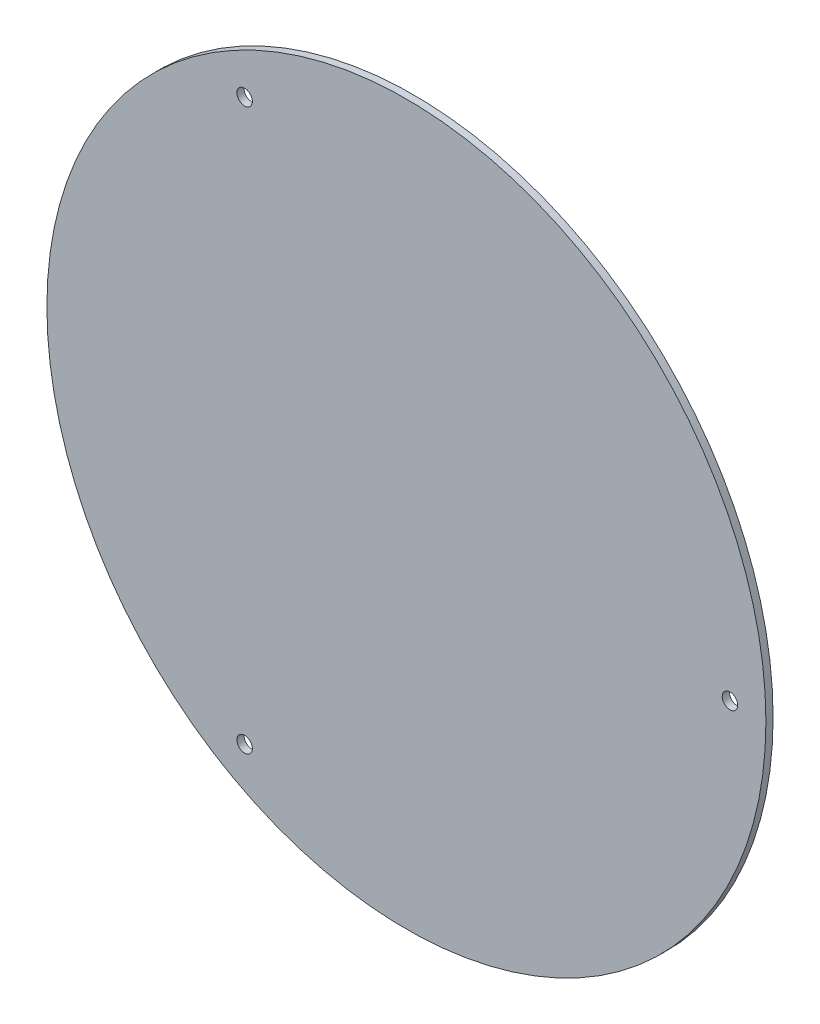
ISO-10303-21;
HEADER;
FILE_DESCRIPTION(('STEP AP214'),'2;1');
FILE_NAME('part.step','',(''),(''),'','','');
FILE_SCHEMA(('AUTOMOTIVE_DESIGN { 1 0 10303 214 1 1 1 1 }'));
ENDSEC;
DATA;
#1=APPLICATION_CONTEXT('core data for automotive mechanical design processes');
#2=APPLICATION_PROTOCOL_DEFINITION('international standard','automotive_design',2000,#1);
#3=PRODUCT_CONTEXT('',#1,'mechanical');
#4=PRODUCT('Part','Part','',(#3));
#5=PRODUCT_RELATED_PRODUCT_CATEGORY('part','',(#4));
#6=PRODUCT_DEFINITION_FORMATION('','',#4);
#7=PRODUCT_DEFINITION_CONTEXT('part definition',#1,'design');
#8=PRODUCT_DEFINITION('design','',#6,#7);
#9=PRODUCT_DEFINITION_SHAPE('','',#8);
#10=(LENGTH_UNIT() NAMED_UNIT(*) SI_UNIT(.MILLI.,.METRE.));
#11=(NAMED_UNIT(*) PLANE_ANGLE_UNIT() SI_UNIT($,.RADIAN.));
#12=(NAMED_UNIT(*) SI_UNIT($,.STERADIAN.) SOLID_ANGLE_UNIT());
#13=UNCERTAINTY_MEASURE_WITH_UNIT(LENGTH_MEASURE(1.E-05),#10,'distance_accuracy_value','');
#14=(GEOMETRIC_REPRESENTATION_CONTEXT(3) GLOBAL_UNCERTAINTY_ASSIGNED_CONTEXT((#13)) GLOBAL_UNIT_ASSIGNED_CONTEXT((#10,
#11,#12)) REPRESENTATION_CONTEXT('',''));
#15=CARTESIAN_POINT('',(0.,0.,0.));
#16=DIRECTION('',(0.,0.,1.));
#17=DIRECTION('',(1.,0.,0.));
#18=AXIS2_PLACEMENT_3D('',#15,#16,#17);
#19=CARTESIAN_POINT('',(0.,0.,1.));
#20=DIRECTION('',(0.,0.,1.));
#21=DIRECTION('',(1.,0.,0.));
#22=AXIS2_PLACEMENT_3D('',#19,#20,#21);
#23=PLANE('',#22);
#24=CARTESIAN_POINT('',(-45.0000000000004,-77.9422863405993,1.));
#25=DIRECTION('',(0.,0.,1.));
#26=DIRECTION('',(1.,0.,0.));
#27=AXIS2_PLACEMENT_3D('',#24,#25,#26);
#28=CIRCLE('',#27,2.15000000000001);
#29=CARTESIAN_POINT('',(-42.8500000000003,-77.9422863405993,1.));
#30=VERTEX_POINT('',#29);
#31=EDGE_CURVE('E48',#30,#30,#28,.T.);
#32=ORIENTED_EDGE('',*,*,#31,.F.);
#33=EDGE_LOOP('',(#32));
#34=FACE_BOUND('',#33,.T.);
#35=CARTESIAN_POINT('',(0.,0.,1.));
#36=DIRECTION('',(0.,0.,1.));
#37=DIRECTION('',(1.,0.,0.));
#38=AXIS2_PLACEMENT_3D('',#35,#36,#37);
#39=CIRCLE('',#38,100.);
#40=CARTESIAN_POINT('',(100.,0.,1.));
#41=VERTEX_POINT('',#40);
#42=EDGE_CURVE('E10',#41,#41,#39,.T.);
#43=ORIENTED_EDGE('',*,*,#42,.T.);
#44=EDGE_LOOP('',(#43));
#45=FACE_BOUND('',#44,.T.);
#46=CARTESIAN_POINT('',(90.,0.,1.));
#47=DIRECTION('',(0.,0.,1.));
#48=DIRECTION('',(1.,0.,0.));
#49=AXIS2_PLACEMENT_3D('',#46,#47,#48);
#50=CIRCLE('',#49,2.15);
#51=CARTESIAN_POINT('',(92.15,0.,1.));
#52=VERTEX_POINT('',#51);
#53=EDGE_CURVE('E43',#52,#52,#50,.T.);
#54=ORIENTED_EDGE('',*,*,#53,.F.);
#55=EDGE_LOOP('',(#54));
#56=FACE_BOUND('',#55,.T.);
#57=CARTESIAN_POINT('',(-44.9999999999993,77.9422863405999,1.));
#58=DIRECTION('',(0.,0.,1.));
#59=DIRECTION('',(1.,0.,0.));
#60=AXIS2_PLACEMENT_3D('',#57,#58,#59);
#61=CIRCLE('',#60,2.15);
#62=CARTESIAN_POINT('',(-42.8499999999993,77.9422863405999,1.));
#63=VERTEX_POINT('',#62);
#64=EDGE_CURVE('E54',#63,#63,#61,.T.);
#65=ORIENTED_EDGE('',*,*,#64,.F.);
#66=EDGE_LOOP('',(#65));
#67=FACE_BOUND('',#66,.T.);
#68=ADVANCED_FACE('F32',(#34,#45,#56,#67),#23,.T.);
#69=CARTESIAN_POINT('',(0.,0.,-1.));
#70=DIRECTION('',(0.,0.,1.));
#71=DIRECTION('',(1.,0.,0.));
#72=AXIS2_PLACEMENT_3D('',#69,#70,#71);
#73=PLANE('',#72);
#74=CARTESIAN_POINT('',(-45.0000000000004,-77.9422863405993,-1.));
#75=DIRECTION('',(0.,0.,1.));
#76=DIRECTION('',(1.,0.,0.));
#77=AXIS2_PLACEMENT_3D('',#74,#75,#76);
#78=CIRCLE('',#77,2.15000000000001);
#79=CARTESIAN_POINT('',(-42.8500000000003,-77.9422863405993,-1.));
#80=VERTEX_POINT('',#79);
#81=EDGE_CURVE('E51',#80,#80,#78,.T.);
#82=ORIENTED_EDGE('',*,*,#81,.T.);
#83=EDGE_LOOP('',(#82));
#84=FACE_BOUND('',#83,.T.);
#85=CARTESIAN_POINT('',(0.,0.,-1.));
#86=DIRECTION('',(0.,0.,1.));
#87=DIRECTION('',(1.,0.,0.));
#88=AXIS2_PLACEMENT_3D('',#85,#86,#87);
#89=CIRCLE('',#88,100.);
#90=CARTESIAN_POINT('',(100.,0.,-1.));
#91=VERTEX_POINT('',#90);
#92=EDGE_CURVE('E36',#91,#91,#89,.T.);
#93=ORIENTED_EDGE('',*,*,#92,.F.);
#94=EDGE_LOOP('',(#93));
#95=FACE_BOUND('',#94,.T.);
#96=CARTESIAN_POINT('',(90.,0.,-1.));
#97=DIRECTION('',(0.,0.,1.));
#98=DIRECTION('',(1.,0.,0.));
#99=AXIS2_PLACEMENT_3D('',#96,#97,#98);
#100=CIRCLE('',#99,2.15);
#101=CARTESIAN_POINT('',(92.15,0.,-1.));
#102=VERTEX_POINT('',#101);
#103=EDGE_CURVE('E45',#102,#102,#100,.T.);
#104=ORIENTED_EDGE('',*,*,#103,.T.);
#105=EDGE_LOOP('',(#104));
#106=FACE_BOUND('',#105,.T.);
#107=CARTESIAN_POINT('',(-44.9999999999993,77.9422863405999,-1.));
#108=DIRECTION('',(0.,0.,1.));
#109=DIRECTION('',(1.,0.,0.));
#110=AXIS2_PLACEMENT_3D('',#107,#108,#109);
#111=CIRCLE('',#110,2.15);
#112=CARTESIAN_POINT('',(-42.8499999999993,77.9422863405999,-1.));
#113=VERTEX_POINT('',#112);
#114=EDGE_CURVE('E57',#113,#113,#111,.T.);
#115=ORIENTED_EDGE('',*,*,#114,.T.);
#116=EDGE_LOOP('',(#115));
#117=FACE_BOUND('',#116,.T.);
#118=ADVANCED_FACE('F67',(#84,#95,#106,#117),#73,.F.);
#119=CARTESIAN_POINT('',(0.,0.,1.));
#120=DIRECTION('',(0.,0.,-1.));
#121=DIRECTION('',(-1.,0.,0.));
#122=AXIS2_PLACEMENT_3D('',#119,#120,#121);
#123=CYLINDRICAL_SURFACE('',#122,100.);
#124=ORIENTED_EDGE('',*,*,#42,.F.);
#125=EDGE_LOOP('',(#124));
#126=FACE_BOUND('',#125,.T.);
#127=ORIENTED_EDGE('',*,*,#92,.T.);
#128=EDGE_LOOP('',(#127));
#129=FACE_BOUND('',#128,.T.);
#130=ADVANCED_FACE('F34',(#126,#129),#123,.T.);
#131=CARTESIAN_POINT('',(90.,0.,1.));
#132=DIRECTION('',(0.,0.,-1.));
#133=DIRECTION('',(-1.,0.,0.));
#134=AXIS2_PLACEMENT_3D('',#131,#132,#133);
#135=CYLINDRICAL_SURFACE('',#134,2.15);
#136=ORIENTED_EDGE('',*,*,#53,.T.);
#137=EDGE_LOOP('',(#136));
#138=FACE_BOUND('',#137,.T.);
#139=ORIENTED_EDGE('',*,*,#103,.F.);
#140=EDGE_LOOP('',(#139));
#141=FACE_BOUND('',#140,.T.);
#142=ADVANCED_FACE('F76',(#138,#141),#135,.F.);
#143=CARTESIAN_POINT('',(-45.0000000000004,-77.9422863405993,1.));
#144=DIRECTION('',(0.,0.,-1.));
#145=DIRECTION('',(-1.,0.,0.));
#146=AXIS2_PLACEMENT_3D('',#143,#144,#145);
#147=CYLINDRICAL_SURFACE('',#146,2.15000000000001);
#148=ORIENTED_EDGE('',*,*,#31,.T.);
#149=EDGE_LOOP('',(#148));
#150=FACE_BOUND('',#149,.T.);
#151=ORIENTED_EDGE('',*,*,#81,.F.);
#152=EDGE_LOOP('',(#151));
#153=FACE_BOUND('',#152,.T.);
#154=ADVANCED_FACE('F79',(#150,#153),#147,.F.);
#155=CARTESIAN_POINT('',(-44.9999999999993,77.9422863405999,1.));
#156=DIRECTION('',(0.,0.,-1.));
#157=DIRECTION('',(-1.,0.,0.));
#158=AXIS2_PLACEMENT_3D('',#155,#156,#157);
#159=CYLINDRICAL_SURFACE('',#158,2.15);
#160=ORIENTED_EDGE('',*,*,#64,.T.);
#161=EDGE_LOOP('',(#160));
#162=FACE_BOUND('',#161,.T.);
#163=ORIENTED_EDGE('',*,*,#114,.F.);
#164=EDGE_LOOP('',(#163));
#165=FACE_BOUND('',#164,.T.);
#166=ADVANCED_FACE('F63',(#162,#165),#159,.F.);
#167=CLOSED_SHELL('',(#68,#118,#130,#142,#154,#166));
#168=MANIFOLD_SOLID_BREP('B2',#167);
#169=ADVANCED_BREP_SHAPE_REPRESENTATION('',(#18,#168),#14);
#170=SHAPE_DEFINITION_REPRESENTATION(#9,#169);
ENDSEC;
END-ISO-10303-21;
